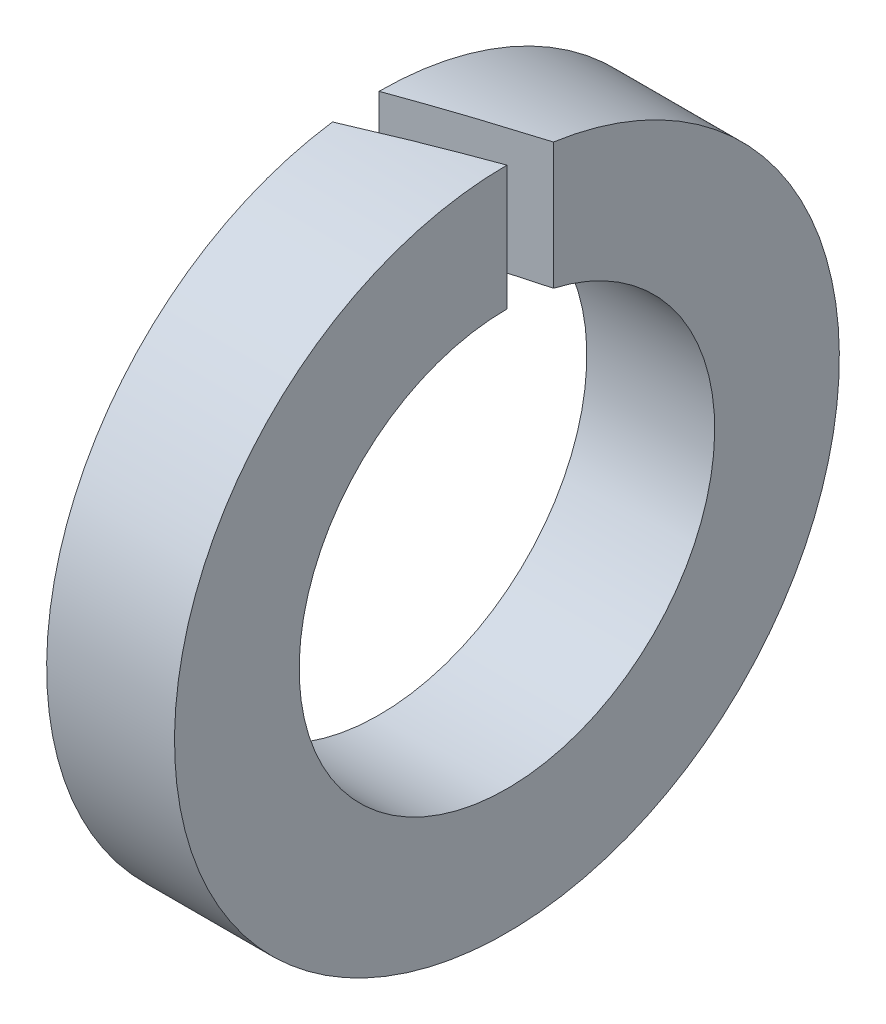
ISO-10303-21;
HEADER;
FILE_DESCRIPTION(('STEP AP214'),'2;1');
FILE_NAME('part.step','',(''),(''),'','','');
FILE_SCHEMA(('AUTOMOTIVE_DESIGN { 1 0 10303 214 1 1 1 1 }'));
ENDSEC;
DATA;
#1=APPLICATION_CONTEXT('core data for automotive mechanical design processes');
#2=APPLICATION_PROTOCOL_DEFINITION('international standard','automotive_design',2000,#1);
#3=PRODUCT_CONTEXT('',#1,'mechanical');
#4=PRODUCT('Part','Part','',(#3));
#5=PRODUCT_RELATED_PRODUCT_CATEGORY('part','',(#4));
#6=PRODUCT_DEFINITION_FORMATION('','',#4);
#7=PRODUCT_DEFINITION_CONTEXT('part definition',#1,'design');
#8=PRODUCT_DEFINITION('design','',#6,#7);
#9=PRODUCT_DEFINITION_SHAPE('','',#8);
#10=(LENGTH_UNIT() NAMED_UNIT(*) SI_UNIT(.MILLI.,.METRE.));
#11=(NAMED_UNIT(*) PLANE_ANGLE_UNIT() SI_UNIT($,.RADIAN.));
#12=(NAMED_UNIT(*) SI_UNIT($,.STERADIAN.) SOLID_ANGLE_UNIT());
#13=UNCERTAINTY_MEASURE_WITH_UNIT(LENGTH_MEASURE(1.E-05),#10,'distance_accuracy_value','');
#14=(GEOMETRIC_REPRESENTATION_CONTEXT(3) GLOBAL_UNCERTAINTY_ASSIGNED_CONTEXT((#13)) GLOBAL_UNIT_ASSIGNED_CONTEXT((#10,
#11,#12)) REPRESENTATION_CONTEXT('',''));
#15=CARTESIAN_POINT('',(0.,0.,0.));
#16=DIRECTION('',(0.,0.,1.));
#17=DIRECTION('',(1.,0.,0.));
#18=AXIS2_PLACEMENT_3D('',#15,#16,#17);
#19=CARTESIAN_POINT('',(0.,0.,-5.2));
#20=DIRECTION('',(1.,0.,0.));
#21=DIRECTION('',(0.,0.,-1.));
#22=AXIS2_PLACEMENT_3D('',#19,#20,#21);
#23=PLANE('',#22);
#24=DIRECTION('',(0.,-1.,0.));
#25=VECTOR('',#24,1.);
#26=CARTESIAN_POINT('',(0.,5.2,0.727940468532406));
#27=LINE('',#26,#25);
#28=CARTESIAN_POINT('',(0.,5.14879623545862,0.727940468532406));
#29=VERTEX_POINT('',#28);
#30=CARTESIAN_POINT('',(0.,3.16742840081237,0.727940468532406));
#31=VERTEX_POINT('',#30);
#32=EDGE_CURVE('E45',#29,#31,#27,.T.);
#33=ORIENTED_EDGE('',*,*,#32,.T.);
#34=CARTESIAN_POINT('',(0.,0.,0.));
#35=DIRECTION('',(-1.,0.,0.));
#36=DIRECTION('',(0.,0.,1.));
#37=AXIS2_PLACEMENT_3D('',#34,#35,#36);
#38=CIRCLE('',#37,3.25);
#39=CARTESIAN_POINT('',(0.,3.25,0.));
#40=VERTEX_POINT('',#39);
#41=EDGE_CURVE('E79',#40,#31,#38,.T.);
#42=ORIENTED_EDGE('',*,*,#41,.F.);
#43=DIRECTION('',(0.,-1.,0.));
#44=VECTOR('',#43,1.);
#45=CARTESIAN_POINT('',(0.,5.2,0.));
#46=LINE('',#45,#44);
#47=CARTESIAN_POINT('',(0.,5.2,0.));
#48=VERTEX_POINT('',#47);
#49=EDGE_CURVE('E88',#48,#40,#46,.T.);
#50=ORIENTED_EDGE('',*,*,#49,.F.);
#51=CARTESIAN_POINT('',(0.,0.,0.));
#52=DIRECTION('',(-1.,0.,0.));
#53=DIRECTION('',(0.,0.,1.));
#54=AXIS2_PLACEMENT_3D('',#51,#52,#53);
#55=CIRCLE('',#54,5.2);
#56=EDGE_CURVE('E77',#48,#29,#55,.T.);
#57=ORIENTED_EDGE('',*,*,#56,.T.);
#58=EDGE_LOOP('',(#33,#42,#50,#57));
#59=FACE_BOUND('',#58,.T.);
#60=ADVANCED_FACE('F24',(#59),#23,.F.);
#61=CARTESIAN_POINT('',(0.,0.,0.));
#62=DIRECTION('',(-1.,0.,0.));
#63=DIRECTION('',(0.,0.,1.));
#64=AXIS2_PLACEMENT_3D('',#61,#62,#63);
#65=CYLINDRICAL_SURFACE('',#64,3.25);
#66=CARTESIAN_POINT('',(2.,0.,0.));
#67=DIRECTION('',(-0.34202014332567,0.,-0.939692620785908));
#68=DIRECTION('',(-0.939692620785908,0.,0.34202014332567));
#69=AXIS2_PLACEMENT_3D('',#66,#67,#68);
#70=ELLIPSE('',#69,9.50236430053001,3.25);
#71=CARTESIAN_POINT('',(2.,3.25,0.));
#72=VERTEX_POINT('',#71);
#73=EDGE_CURVE('E81',#72,#31,#70,.F.);
#74=ORIENTED_EDGE('',*,*,#73,.F.);
#75=CARTESIAN_POINT('',(2.,0.,0.));
#76=DIRECTION('',(-1.,0.,0.));
#77=DIRECTION('',(0.,0.,1.));
#78=AXIS2_PLACEMENT_3D('',#75,#76,#77);
#79=CIRCLE('',#78,3.25);
#80=CARTESIAN_POINT('',(2.,3.16742840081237,-0.727940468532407));
#81=VERTEX_POINT('',#80);
#82=EDGE_CURVE('E74',#81,#72,#79,.T.);
#83=ORIENTED_EDGE('',*,*,#82,.F.);
#84=CARTESIAN_POINT('',(0.,0.,0.));
#85=DIRECTION('',(0.34202014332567,0.,0.939692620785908));
#86=DIRECTION('',(-0.939692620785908,0.,0.34202014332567));
#87=AXIS2_PLACEMENT_3D('',#84,#85,#86);
#88=ELLIPSE('',#87,9.50236430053,3.25);
#89=EDGE_CURVE('E96',#40,#81,#88,.F.);
#90=ORIENTED_EDGE('',*,*,#89,.F.);
#91=ORIENTED_EDGE('',*,*,#41,.T.);
#92=EDGE_LOOP('',(#74,#83,#90,#91));
#93=FACE_BOUND('',#92,.T.);
#94=ADVANCED_FACE('F98',(#93),#65,.F.);
#95=CARTESIAN_POINT('',(2.,0.,-5.2));
#96=DIRECTION('',(-1.,0.,0.));
#97=DIRECTION('',(0.,0.,1.));
#98=AXIS2_PLACEMENT_3D('',#95,#96,#97);
#99=PLANE('',#98);
#100=DIRECTION('',(0.,-1.,0.));
#101=VECTOR('',#100,1.);
#102=CARTESIAN_POINT('',(2.,5.2,0.));
#103=LINE('',#102,#101);
#104=CARTESIAN_POINT('',(2.,5.2,0.));
#105=VERTEX_POINT('',#104);
#106=EDGE_CURVE('E62',#105,#72,#103,.T.);
#107=ORIENTED_EDGE('',*,*,#106,.F.);
#108=CARTESIAN_POINT('',(2.,0.,0.));
#109=DIRECTION('',(-1.,0.,0.));
#110=DIRECTION('',(0.,0.,1.));
#111=AXIS2_PLACEMENT_3D('',#108,#109,#110);
#112=CIRCLE('',#111,5.2);
#113=CARTESIAN_POINT('',(2.,5.14879623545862,-0.727940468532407));
#114=VERTEX_POINT('',#113);
#115=EDGE_CURVE('E72',#114,#105,#112,.T.);
#116=ORIENTED_EDGE('',*,*,#115,.F.);
#117=DIRECTION('',(0.,-1.,0.));
#118=VECTOR('',#117,1.);
#119=CARTESIAN_POINT('',(2.,5.2,-0.727940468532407));
#120=LINE('',#119,#118);
#121=EDGE_CURVE('E38',#114,#81,#120,.T.);
#122=ORIENTED_EDGE('',*,*,#121,.T.);
#123=ORIENTED_EDGE('',*,*,#82,.T.);
#124=EDGE_LOOP('',(#107,#116,#122,#123));
#125=FACE_BOUND('',#124,.T.);
#126=ADVANCED_FACE('F71',(#125),#99,.F.);
#127=CARTESIAN_POINT('',(0.,0.,0.));
#128=DIRECTION('',(-1.,0.,0.));
#129=DIRECTION('',(0.,0.,1.));
#130=AXIS2_PLACEMENT_3D('',#127,#128,#129);
#131=CYLINDRICAL_SURFACE('',#130,5.2);
#132=CARTESIAN_POINT('',(2.,0.,0.));
#133=DIRECTION('',(-0.34202014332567,0.,-0.939692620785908));
#134=DIRECTION('',(-0.939692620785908,0.,0.34202014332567));
#135=AXIS2_PLACEMENT_3D('',#132,#133,#134);
#136=ELLIPSE('',#135,15.203782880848,5.2);
#137=EDGE_CURVE('E11',#29,#105,#136,.T.);
#138=ORIENTED_EDGE('',*,*,#137,.F.);
#139=ORIENTED_EDGE('',*,*,#56,.F.);
#140=CARTESIAN_POINT('',(0.,0.,0.));
#141=DIRECTION('',(0.34202014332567,0.,0.939692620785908));
#142=DIRECTION('',(-0.939692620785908,0.,0.34202014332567));
#143=AXIS2_PLACEMENT_3D('',#140,#141,#142);
#144=ELLIPSE('',#143,15.203782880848,5.2);
#145=EDGE_CURVE('E31',#114,#48,#144,.T.);
#146=ORIENTED_EDGE('',*,*,#145,.F.);
#147=ORIENTED_EDGE('',*,*,#115,.T.);
#148=EDGE_LOOP('',(#138,#139,#146,#147));
#149=FACE_BOUND('',#148,.T.);
#150=ADVANCED_FACE('F76',(#149),#131,.T.);
#151=CARTESIAN_POINT('',(0.,5.2,0.));
#152=DIRECTION('',(0.34202014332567,0.,0.939692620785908));
#153=DIRECTION('',(0.939692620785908,0.,-0.34202014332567));
#154=AXIS2_PLACEMENT_3D('',#151,#152,#153);
#155=PLANE('',#154);
#156=ORIENTED_EDGE('',*,*,#89,.T.);
#157=ORIENTED_EDGE('',*,*,#121,.F.);
#158=ORIENTED_EDGE('',*,*,#145,.T.);
#159=ORIENTED_EDGE('',*,*,#49,.T.);
#160=EDGE_LOOP('',(#156,#157,#158,#159));
#161=FACE_BOUND('',#160,.T.);
#162=ADVANCED_FACE('F87',(#161),#155,.T.);
#163=CARTESIAN_POINT('',(2.,5.2,0.));
#164=DIRECTION('',(-0.34202014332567,0.,-0.939692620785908));
#165=DIRECTION('',(-0.939692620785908,0.,0.34202014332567));
#166=AXIS2_PLACEMENT_3D('',#163,#164,#165);
#167=PLANE('',#166);
#168=ORIENTED_EDGE('',*,*,#73,.T.);
#169=ORIENTED_EDGE('',*,*,#32,.F.);
#170=ORIENTED_EDGE('',*,*,#137,.T.);
#171=ORIENTED_EDGE('',*,*,#106,.T.);
#172=EDGE_LOOP('',(#168,#169,#170,#171));
#173=FACE_BOUND('',#172,.T.);
#174=ADVANCED_FACE('F61',(#173),#167,.T.);
#175=CLOSED_SHELL('',(#60,#94,#126,#150,#162,#174));
#176=MANIFOLD_SOLID_BREP('B2',#175);
#177=ADVANCED_BREP_SHAPE_REPRESENTATION('',(#18,#176),#14);
#178=SHAPE_DEFINITION_REPRESENTATION(#9,#177);
ENDSEC;
END-ISO-10303-21;
